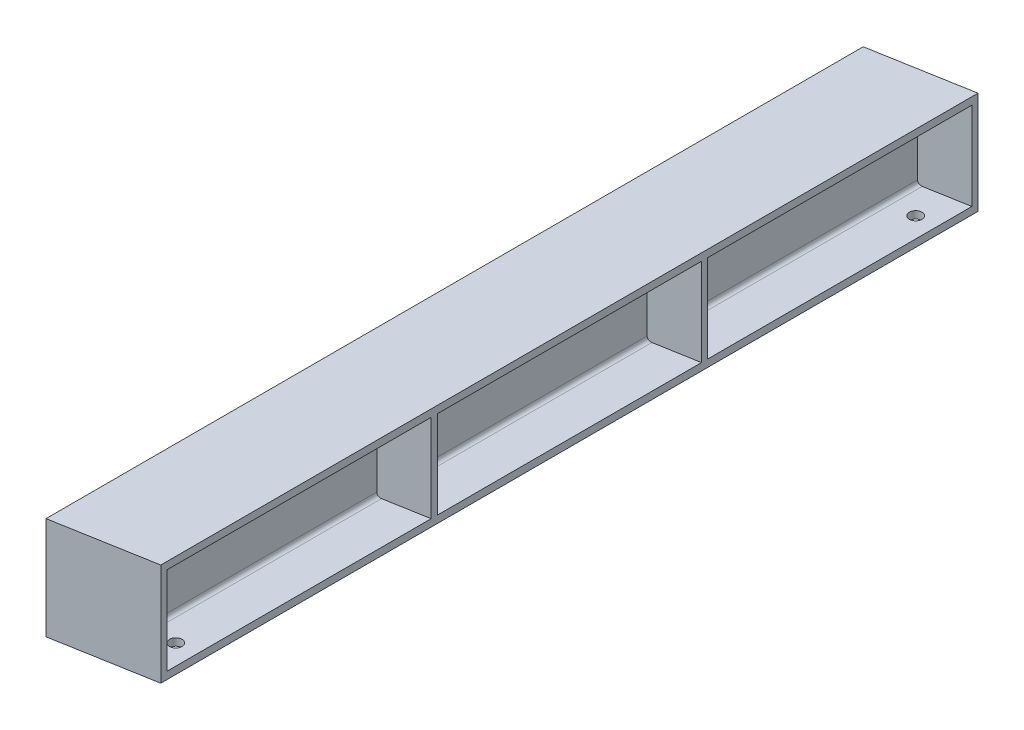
ISO-10303-21;
HEADER;
FILE_DESCRIPTION(('STEP AP214'),'2;1');
FILE_NAME('part.step','',(''),(''),'','','');
FILE_SCHEMA(('AUTOMOTIVE_DESIGN { 1 0 10303 214 1 1 1 1 }'));
ENDSEC;
DATA;
#1=APPLICATION_CONTEXT('core data for automotive mechanical design processes');
#2=APPLICATION_PROTOCOL_DEFINITION('international standard','automotive_design',2000,#1);
#3=PRODUCT_CONTEXT('',#1,'mechanical');
#4=PRODUCT('Part','Part','',(#3));
#5=PRODUCT_RELATED_PRODUCT_CATEGORY('part','',(#4));
#6=PRODUCT_DEFINITION_FORMATION('','',#4);
#7=PRODUCT_DEFINITION_CONTEXT('part definition',#1,'design');
#8=PRODUCT_DEFINITION('design','',#6,#7);
#9=PRODUCT_DEFINITION_SHAPE('','',#8);
#10=(LENGTH_UNIT() NAMED_UNIT(*) SI_UNIT(.MILLI.,.METRE.));
#11=(NAMED_UNIT(*) PLANE_ANGLE_UNIT() SI_UNIT($,.RADIAN.));
#12=(NAMED_UNIT(*) SI_UNIT($,.STERADIAN.) SOLID_ANGLE_UNIT());
#13=UNCERTAINTY_MEASURE_WITH_UNIT(LENGTH_MEASURE(1.E-05),#10,'distance_accuracy_value','');
#14=(GEOMETRIC_REPRESENTATION_CONTEXT(3) GLOBAL_UNCERTAINTY_ASSIGNED_CONTEXT((#13)) GLOBAL_UNIT_ASSIGNED_CONTEXT((#10,
#11,#12)) REPRESENTATION_CONTEXT('',''));
#15=CARTESIAN_POINT('',(0.,0.,0.));
#16=DIRECTION('',(0.,0.,1.));
#17=DIRECTION('',(1.,0.,0.));
#18=AXIS2_PLACEMENT_3D('',#15,#16,#17);
#19=CARTESIAN_POINT('',(0.,11.557,-660.4));
#20=DIRECTION('',(0.,1.,0.));
#21=DIRECTION('',(-1.,0.,0.));
#22=AXIS2_PLACEMENT_3D('',#19,#20,#21);
#23=PLANE('',#22);
#24=CARTESIAN_POINT('',(31.75,11.557,593.546540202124));
#25=DIRECTION('',(0.,1.,0.));
#26=DIRECTION('',(0.,0.,1.));
#27=AXIS2_PLACEMENT_3D('',#24,#25,#26);
#28=CIRCLE('',#27,9.92123999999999);
#29=CARTESIAN_POINT('',(31.75,11.557,603.467780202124));
#30=VERTEX_POINT('',#29);
#31=EDGE_CURVE('E652',#30,#30,#28,.T.);
#32=ORIENTED_EDGE('',*,*,#31,.F.);
#33=EDGE_LOOP('',(#32));
#34=FACE_BOUND('',#33,.T.);
#35=DIRECTION('',(-0.984809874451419,0.,0.173636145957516));
#36=VECTOR('',#35,1.);
#37=CARTESIAN_POINT('',(224.201054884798,11.557,611.198211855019));
#38=LINE('',#37,#36);
#39=CARTESIAN_POINT('',(66.802,11.557,638.949929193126));
#40=VERTEX_POINT('',#39);
#41=CARTESIAN_POINT('',(0.,11.557,650.728082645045));
#42=VERTEX_POINT('',#41);
#43=EDGE_CURVE('E347',#40,#42,#38,.T.);
#44=ORIENTED_EDGE('',*,*,#43,.F.);
#45=DIRECTION('',(0.,0.,1.));
#46=VECTOR('',#45,1.);
#47=CARTESIAN_POINT('',(66.802,11.557,-660.4));
#48=LINE('',#47,#46);
#49=CARTESIAN_POINT('',(66.802,11.557,220.655346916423));
#50=VERTEX_POINT('',#49);
#51=EDGE_CURVE('E383',#50,#40,#48,.T.);
#52=ORIENTED_EDGE('',*,*,#51,.F.);
#53=DIRECTION('',(0.984809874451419,0.,-0.173636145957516));
#54=VECTOR('',#53,1.);
#55=CARTESIAN_POINT('',(152.673270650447,11.557,205.515006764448));
#56=LINE('',#55,#54);
#57=CARTESIAN_POINT('',(0.,11.557,232.433500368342));
#58=VERTEX_POINT('',#57);
#59=EDGE_CURVE('E372',#58,#50,#56,.T.);
#60=ORIENTED_EDGE('',*,*,#59,.F.);
#61=DIRECTION('',(0.,0.,1.));
#62=VECTOR('',#61,1.);
#63=CARTESIAN_POINT('',(0.,11.557,-660.4));
#64=LINE('',#63,#62);
#65=EDGE_CURVE('E365',#58,#42,#64,.T.);
#66=ORIENTED_EDGE('',*,*,#65,.T.);
#67=EDGE_LOOP('',(#44,#52,#60,#66));
#68=FACE_BOUND('',#67,.T.);
#69=ADVANCED_FACE('F36',(#34,#68),#23,.T.);
#70=CARTESIAN_POINT('',(66.802,17.907,-660.4));
#71=DIRECTION('',(0.,0.,1.));
#72=DIRECTION('',(1.,0.,0.));
#73=AXIS2_PLACEMENT_3D('',#70,#71,#72);
#74=CYLINDRICAL_SURFACE('',#73,6.35);
#75=CARTESIAN_POINT('',(66.802,17.907,638.949929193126));
#76=DIRECTION('',(-0.173636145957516,0.,-0.984809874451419));
#77=DIRECTION('',(-0.984809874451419,0.,0.173636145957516));
#78=AXIS2_PLACEMENT_3D('',#75,#76,#77);
#79=ELLIPSE('',#78,6.44794509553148,6.35);
#80=CARTESIAN_POINT('',(73.152,17.907,637.830332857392));
#81=VERTEX_POINT('',#80);
#82=EDGE_CURVE('E353',#81,#40,#79,.T.);
#83=ORIENTED_EDGE('',*,*,#82,.F.);
#84=DIRECTION('',(0.,0.,1.));
#85=VECTOR('',#84,1.);
#86=CARTESIAN_POINT('',(73.152,17.907,-660.4));
#87=LINE('',#86,#85);
#88=CARTESIAN_POINT('',(73.152,17.907,219.535750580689));
#89=VERTEX_POINT('',#88);
#90=EDGE_CURVE('E693',#89,#81,#87,.T.);
#91=ORIENTED_EDGE('',*,*,#90,.F.);
#92=CARTESIAN_POINT('',(66.802,17.907,220.655346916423));
#93=DIRECTION('',(0.173636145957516,0.,0.984809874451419));
#94=DIRECTION('',(-0.984809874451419,0.,0.173636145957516));
#95=AXIS2_PLACEMENT_3D('',#92,#93,#94);
#96=ELLIPSE('',#95,6.44794509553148,6.35);
#97=EDGE_CURVE('E542',#50,#89,#96,.T.);
#98=ORIENTED_EDGE('',*,*,#97,.F.);
#99=ORIENTED_EDGE('',*,*,#51,.T.);
#100=EDGE_LOOP('',(#83,#91,#98,#99));
#101=FACE_BOUND('',#100,.T.);
#102=ADVANCED_FACE('F859',(#101),#74,.F.);
#103=CARTESIAN_POINT('',(73.152,17.907,-660.4));
#104=DIRECTION('',(-1.,0.,0.));
#105=DIRECTION('',(0.,-1.,0.));
#106=AXIS2_PLACEMENT_3D('',#103,#104,#105);
#107=PLANE('',#106);
#108=DIRECTION('',(0.,-1.,0.));
#109=VECTOR('',#108,1.);
#110=CARTESIAN_POINT('',(73.152,17.9069999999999,637.830332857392));
#111=LINE('',#110,#109);
#112=CARTESIAN_POINT('',(73.152,144.145,637.830332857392));
#113=VERTEX_POINT('',#112);
#114=EDGE_CURVE('E617',#113,#81,#111,.T.);
#115=ORIENTED_EDGE('',*,*,#114,.F.);
#116=DIRECTION('',(0.,0.,1.));
#117=VECTOR('',#116,1.);
#118=CARTESIAN_POINT('',(73.152,144.145,-660.4));
#119=LINE('',#118,#117);
#120=CARTESIAN_POINT('',(73.152,144.145,219.535750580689));
#121=VERTEX_POINT('',#120);
#122=EDGE_CURVE('E696',#121,#113,#119,.T.);
#123=ORIENTED_EDGE('',*,*,#122,.F.);
#124=DIRECTION('',(0.,1.,0.));
#125=VECTOR('',#124,1.);
#126=CARTESIAN_POINT('',(73.152,17.9069999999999,219.535750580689));
#127=LINE('',#126,#125);
#128=EDGE_CURVE('E544',#89,#121,#127,.T.);
#129=ORIENTED_EDGE('',*,*,#128,.F.);
#130=ORIENTED_EDGE('',*,*,#90,.T.);
#131=EDGE_LOOP('',(#115,#123,#129,#130));
#132=FACE_BOUND('',#131,.T.);
#133=ADVANCED_FACE('F864',(#132),#107,.T.);
#134=CARTESIAN_POINT('',(66.802,144.145,-660.4));
#135=DIRECTION('',(0.,0.,1.));
#136=DIRECTION('',(1.,0.,0.));
#137=AXIS2_PLACEMENT_3D('',#134,#135,#136);
#138=CYLINDRICAL_SURFACE('',#137,6.34999999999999);
#139=CARTESIAN_POINT('',(66.802,144.145,638.949929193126));
#140=DIRECTION('',(-0.173636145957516,0.,-0.984809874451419));
#141=DIRECTION('',(-0.984809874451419,0.,0.173636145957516));
#142=AXIS2_PLACEMENT_3D('',#139,#140,#141);
#143=ELLIPSE('',#142,6.44794509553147,6.34999999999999);
#144=CARTESIAN_POINT('',(66.8019999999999,150.495,638.949929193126));
#145=VERTEX_POINT('',#144);
#146=EDGE_CURVE('E619',#145,#113,#143,.T.);
#147=ORIENTED_EDGE('',*,*,#146,.F.);
#148=DIRECTION('',(0.,0.,1.));
#149=VECTOR('',#148,1.);
#150=CARTESIAN_POINT('',(66.802,150.495,-660.4));
#151=LINE('',#150,#149);
#152=CARTESIAN_POINT('',(66.8019999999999,150.495,220.655346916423));
#153=VERTEX_POINT('',#152);
#154=EDGE_CURVE('E715',#153,#145,#151,.T.);
#155=ORIENTED_EDGE('',*,*,#154,.F.);
#156=CARTESIAN_POINT('',(66.802,144.145,220.655346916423));
#157=DIRECTION('',(0.173636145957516,0.,0.984809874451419));
#158=DIRECTION('',(-0.984809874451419,0.,0.173636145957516));
#159=AXIS2_PLACEMENT_3D('',#156,#157,#158);
#160=ELLIPSE('',#159,6.44794509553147,6.34999999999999);
#161=EDGE_CURVE('E547',#121,#153,#160,.T.);
#162=ORIENTED_EDGE('',*,*,#161,.F.);
#163=ORIENTED_EDGE('',*,*,#122,.T.);
#164=EDGE_LOOP('',(#147,#155,#162,#163));
#165=FACE_BOUND('',#164,.T.);
#166=ADVANCED_FACE('F984',(#165),#138,.F.);
#167=CARTESIAN_POINT('',(66.802,150.495,-660.4));
#168=DIRECTION('',(0.,-1.,0.));
#169=DIRECTION('',(0.,0.,-1.));
#170=AXIS2_PLACEMENT_3D('',#167,#168,#169);
#171=PLANE('',#170);
#172=DIRECTION('',(0.984809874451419,0.,-0.173636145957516));
#173=VECTOR('',#172,1.);
#174=CARTESIAN_POINT('',(288.989007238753,150.495,599.775163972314));
#175=LINE('',#174,#173);
#176=CARTESIAN_POINT('',(0.,150.495,650.728082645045));
#177=VERTEX_POINT('',#176);
#178=EDGE_CURVE('E621',#177,#145,#175,.T.);
#179=ORIENTED_EDGE('',*,*,#178,.F.);
#180=DIRECTION('',(0.,0.,1.));
#181=VECTOR('',#180,1.);
#182=CARTESIAN_POINT('',(0.,150.495,-660.4));
#183=LINE('',#182,#181);
#184=CARTESIAN_POINT('',(0.,150.495,232.433500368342));
#185=VERTEX_POINT('',#184);
#186=EDGE_CURVE('E367',#185,#177,#183,.T.);
#187=ORIENTED_EDGE('',*,*,#186,.F.);
#188=DIRECTION('',(-0.984809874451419,0.,0.173636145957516));
#189=VECTOR('',#188,1.);
#190=CARTESIAN_POINT('',(217.461223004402,150.495,194.091958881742));
#191=LINE('',#190,#189);
#192=EDGE_CURVE('E550',#153,#185,#191,.T.);
#193=ORIENTED_EDGE('',*,*,#192,.F.);
#194=ORIENTED_EDGE('',*,*,#154,.T.);
#195=EDGE_LOOP('',(#179,#187,#193,#194));
#196=FACE_BOUND('',#195,.T.);
#197=ADVANCED_FACE('F971',(#196),#171,.T.);
#198=CARTESIAN_POINT('',(154.432,150.495,-660.4));
#199=DIRECTION('',(0.,-1.,0.));
#200=DIRECTION('',(0.,0.,-1.));
#201=AXIS2_PLACEMENT_3D('',#198,#199,#200);
#202=PLANE('',#201);
#203=DIRECTION('',(0.984809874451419,0.,-0.173636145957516));
#204=VECTOR('',#203,1.);
#205=CARTESIAN_POINT('',(373.977005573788,150.495,584.790557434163));
#206=LINE('',#205,#204);
#207=CARTESIAN_POINT('',(87.63,150.495,635.277653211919));
#208=VERTEX_POINT('',#207);
#209=CARTESIAN_POINT('',(154.432,150.495,623.49949976));
#210=VERTEX_POINT('',#209);
#211=EDGE_CURVE('E52',#208,#210,#206,.T.);
#212=ORIENTED_EDGE('',*,*,#211,.F.);
#213=DIRECTION('',(0.,0.,1.));
#214=VECTOR('',#213,1.);
#215=CARTESIAN_POINT('',(87.63,150.495,-660.4));
#216=LINE('',#215,#214);
#217=CARTESIAN_POINT('',(87.63,150.495,216.983070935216));
#218=VERTEX_POINT('',#217);
#219=EDGE_CURVE('E757',#218,#208,#216,.T.);
#220=ORIENTED_EDGE('',*,*,#219,.F.);
#221=DIRECTION('',(-0.984809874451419,0.,0.173636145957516));
#222=VECTOR('',#221,1.);
#223=CARTESIAN_POINT('',(302.449221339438,150.495,179.107352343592));
#224=LINE('',#223,#222);
#225=CARTESIAN_POINT('',(154.432,150.495,205.204917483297));
#226=VERTEX_POINT('',#225);
#227=EDGE_CURVE('E554',#226,#218,#224,.T.);
#228=ORIENTED_EDGE('',*,*,#227,.F.);
#229=DIRECTION('',(0.,0.,1.));
#230=VECTOR('',#229,1.);
#231=CARTESIAN_POINT('',(154.432,150.495,-660.4));
#232=LINE('',#231,#230);
#233=EDGE_CURVE('E752',#226,#210,#232,.T.);
#234=ORIENTED_EDGE('',*,*,#233,.T.);
#235=EDGE_LOOP('',(#212,#220,#228,#234));
#236=FACE_BOUND('',#235,.T.);
#237=ADVANCED_FACE('F838',(#236),#202,.T.);
#238=CARTESIAN_POINT('',(87.63,144.145,-660.4));
#239=DIRECTION('',(0.,0.,1.));
#240=DIRECTION('',(1.,0.,0.));
#241=AXIS2_PLACEMENT_3D('',#238,#239,#240);
#242=CYLINDRICAL_SURFACE('',#241,6.34999999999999);
#243=CARTESIAN_POINT('',(87.63,144.145,635.277653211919));
#244=DIRECTION('',(-0.173636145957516,0.,-0.984809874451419));
#245=DIRECTION('',(-0.984809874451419,0.,0.173636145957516));
#246=AXIS2_PLACEMENT_3D('',#243,#244,#245);
#247=ELLIPSE('',#246,6.44794509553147,6.34999999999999);
#248=CARTESIAN_POINT('',(81.28,144.145,636.397249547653));
#249=VERTEX_POINT('',#248);
#250=EDGE_CURVE('E59',#249,#208,#247,.T.);
#251=ORIENTED_EDGE('',*,*,#250,.F.);
#252=DIRECTION('',(0.,0.,1.));
#253=VECTOR('',#252,1.);
#254=CARTESIAN_POINT('',(81.28,144.145,-660.4));
#255=LINE('',#254,#253);
#256=CARTESIAN_POINT('',(81.28,144.145,218.10266727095));
#257=VERTEX_POINT('',#256);
#258=EDGE_CURVE('E762',#257,#249,#255,.T.);
#259=ORIENTED_EDGE('',*,*,#258,.F.);
#260=CARTESIAN_POINT('',(87.63,144.145,216.983070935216));
#261=DIRECTION('',(0.173636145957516,0.,0.984809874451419));
#262=DIRECTION('',(-0.984809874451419,0.,0.173636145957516));
#263=AXIS2_PLACEMENT_3D('',#260,#261,#262);
#264=ELLIPSE('',#263,6.44794509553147,6.34999999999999);
#265=EDGE_CURVE('E558',#218,#257,#264,.T.);
#266=ORIENTED_EDGE('',*,*,#265,.F.);
#267=ORIENTED_EDGE('',*,*,#219,.T.);
#268=EDGE_LOOP('',(#251,#259,#266,#267));
#269=FACE_BOUND('',#268,.T.);
#270=ADVANCED_FACE('F812',(#269),#242,.F.);
#271=CARTESIAN_POINT('',(81.28,144.145,-660.4));
#272=DIRECTION('',(1.,0.,0.));
#273=DIRECTION('',(0.,1.,0.));
#274=AXIS2_PLACEMENT_3D('',#271,#272,#273);
#275=PLANE('',#274);
#276=DIRECTION('',(0.,1.,0.));
#277=VECTOR('',#276,1.);
#278=CARTESIAN_POINT('',(81.28,144.145,636.397249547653));
#279=LINE('',#278,#277);
#280=CARTESIAN_POINT('',(81.28,17.907,636.397249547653));
#281=VERTEX_POINT('',#280);
#282=EDGE_CURVE('E625',#281,#249,#279,.T.);
#283=ORIENTED_EDGE('',*,*,#282,.F.);
#284=DIRECTION('',(0.,0.,1.));
#285=VECTOR('',#284,1.);
#286=CARTESIAN_POINT('',(81.28,17.907,-660.4));
#287=LINE('',#286,#285);
#288=CARTESIAN_POINT('',(81.28,17.907,218.10266727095));
#289=VERTEX_POINT('',#288);
#290=EDGE_CURVE('E768',#289,#281,#287,.T.);
#291=ORIENTED_EDGE('',*,*,#290,.F.);
#292=DIRECTION('',(0.,-1.,0.));
#293=VECTOR('',#292,1.);
#294=CARTESIAN_POINT('',(81.28,144.145,218.10266727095));
#295=LINE('',#294,#293);
#296=EDGE_CURVE('E562',#257,#289,#295,.T.);
#297=ORIENTED_EDGE('',*,*,#296,.F.);
#298=ORIENTED_EDGE('',*,*,#258,.T.);
#299=EDGE_LOOP('',(#283,#291,#297,#298));
#300=FACE_BOUND('',#299,.T.);
#301=ADVANCED_FACE('F819',(#300),#275,.T.);
#302=CARTESIAN_POINT('',(87.63,17.907,-660.4));
#303=DIRECTION('',(0.,0.,1.));
#304=DIRECTION('',(1.,0.,0.));
#305=AXIS2_PLACEMENT_3D('',#302,#303,#304);
#306=CYLINDRICAL_SURFACE('',#305,6.34999999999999);
#307=CARTESIAN_POINT('',(87.63,17.907,635.277653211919));
#308=DIRECTION('',(-0.173636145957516,0.,-0.984809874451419));
#309=DIRECTION('',(-0.984809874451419,0.,0.173636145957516));
#310=AXIS2_PLACEMENT_3D('',#307,#308,#309);
#311=ELLIPSE('',#310,6.44794509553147,6.34999999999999);
#312=CARTESIAN_POINT('',(87.63,11.557,635.277653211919));
#313=VERTEX_POINT('',#312);
#314=EDGE_CURVE('E628',#313,#281,#311,.T.);
#315=ORIENTED_EDGE('',*,*,#314,.F.);
#316=DIRECTION('',(0.,0.,1.));
#317=VECTOR('',#316,1.);
#318=CARTESIAN_POINT('',(87.63,11.557,-660.4));
#319=LINE('',#318,#317);
#320=CARTESIAN_POINT('',(87.63,11.557,216.983070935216));
#321=VERTEX_POINT('',#320);
#322=EDGE_CURVE('E773',#321,#313,#319,.T.);
#323=ORIENTED_EDGE('',*,*,#322,.F.);
#324=CARTESIAN_POINT('',(87.63,17.907,216.983070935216));
#325=DIRECTION('',(0.173636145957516,0.,0.984809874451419));
#326=DIRECTION('',(-0.984809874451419,0.,0.173636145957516));
#327=AXIS2_PLACEMENT_3D('',#324,#325,#326);
#328=ELLIPSE('',#327,6.44794509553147,6.34999999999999);
#329=EDGE_CURVE('E566',#289,#321,#328,.T.);
#330=ORIENTED_EDGE('',*,*,#329,.F.);
#331=ORIENTED_EDGE('',*,*,#290,.T.);
#332=EDGE_LOOP('',(#315,#323,#330,#331));
#333=FACE_BOUND('',#332,.T.);
#334=ADVANCED_FACE('F821',(#333),#306,.F.);
#335=CARTESIAN_POINT('',(87.63,11.557,-660.4));
#336=DIRECTION('',(0.,1.,0.));
#337=DIRECTION('',(-1.,0.,0.));
#338=AXIS2_PLACEMENT_3D('',#335,#336,#337);
#339=PLANE('',#338);
#340=CARTESIAN_POINT('',(122.682,11.557,577.513920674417));
#341=DIRECTION('',(0.,1.,0.));
#342=DIRECTION('',(0.,0.,1.));
#343=AXIS2_PLACEMENT_3D('',#340,#341,#342);
#344=CIRCLE('',#343,9.92124);
#345=CARTESIAN_POINT('',(122.682,11.557,587.435160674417));
#346=VERTEX_POINT('',#345);
#347=EDGE_CURVE('E646',#346,#346,#344,.T.);
#348=ORIENTED_EDGE('',*,*,#347,.F.);
#349=EDGE_LOOP('',(#348));
#350=FACE_BOUND('',#349,.T.);
#351=DIRECTION('',(-0.984809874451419,0.,0.173636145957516));
#352=VECTOR('',#351,1.);
#353=CARTESIAN_POINT('',(309.189053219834,11.5569999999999,596.213605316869));
#354=LINE('',#353,#352);
#355=CARTESIAN_POINT('',(154.432,11.557,623.49949976));
#356=VERTEX_POINT('',#355);
#357=EDGE_CURVE('E368',#356,#313,#354,.T.);
#358=ORIENTED_EDGE('',*,*,#357,.F.);
#359=DIRECTION('',(0.,0.,1.));
#360=VECTOR('',#359,1.);
#361=CARTESIAN_POINT('',(154.432,11.557,-660.4));
#362=LINE('',#361,#360);
#363=CARTESIAN_POINT('',(154.432,11.557,205.204917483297));
#364=VERTEX_POINT('',#363);
#365=EDGE_CURVE('E779',#364,#356,#362,.T.);
#366=ORIENTED_EDGE('',*,*,#365,.F.);
#367=DIRECTION('',(0.984809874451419,0.,-0.173636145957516));
#368=VECTOR('',#367,1.);
#369=CARTESIAN_POINT('',(237.661268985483,11.557,190.530400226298));
#370=LINE('',#369,#368);
#371=EDGE_CURVE('E569',#321,#364,#370,.T.);
#372=ORIENTED_EDGE('',*,*,#371,.F.);
#373=ORIENTED_EDGE('',*,*,#322,.T.);
#374=EDGE_LOOP('',(#358,#366,#372,#373));
#375=FACE_BOUND('',#374,.T.);
#376=ADVANCED_FACE('F842',(#350,#375),#339,.T.);
#377=DIRECTION('',(-0.984809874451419,0.,0.173636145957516));
#378=VECTOR('',#377,1.);
#379=CARTESIAN_POINT('',(151.019386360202,11.557,196.134692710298));
#380=LINE('',#379,#378);
#381=CARTESIAN_POINT('',(66.802,11.557,210.983429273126));
#382=VERTEX_POINT('',#381);
#383=CARTESIAN_POINT('',(0.,11.557,222.761582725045));
#384=VERTEX_POINT('',#383);
#385=EDGE_CURVE('E572',#382,#384,#380,.T.);
#386=ORIENTED_EDGE('',*,*,#385,.F.);
#387=CARTESIAN_POINT('',(66.802,11.557,-207.311153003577));
#388=VERTEX_POINT('',#387);
#389=EDGE_CURVE('E381',#388,#382,#48,.T.);
#390=ORIENTED_EDGE('',*,*,#389,.F.);
#391=DIRECTION('',(0.984809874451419,0.,-0.173636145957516));
#392=VECTOR('',#391,1.);
#393=CARTESIAN_POINT('',(79.4916021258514,11.557,-209.548512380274));
#394=LINE('',#393,#392);
#395=CARTESIAN_POINT('',(0.,11.557,-195.532999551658));
#396=VERTEX_POINT('',#395);
#397=EDGE_CURVE('E464',#396,#388,#394,.T.);
#398=ORIENTED_EDGE('',*,*,#397,.F.);
#399=EDGE_CURVE('E373',#396,#384,#64,.T.);
#400=ORIENTED_EDGE('',*,*,#399,.T.);
#401=EDGE_LOOP('',(#386,#390,#398,#400));
#402=FACE_BOUND('',#401,.T.);
#403=ADVANCED_FACE('F670',(#402),#23,.T.);
#404=CARTESIAN_POINT('',(66.802,17.907,210.983429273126));
#405=DIRECTION('',(-0.173636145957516,0.,-0.984809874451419));
#406=DIRECTION('',(-0.984809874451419,0.,0.173636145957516));
#407=AXIS2_PLACEMENT_3D('',#404,#405,#406);
#408=ELLIPSE('',#407,6.44794509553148,6.35);
#409=CARTESIAN_POINT('',(73.152,17.907,209.863832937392));
#410=VERTEX_POINT('',#409);
#411=EDGE_CURVE('E574',#410,#382,#408,.T.);
#412=ORIENTED_EDGE('',*,*,#411,.F.);
#413=CARTESIAN_POINT('',(73.152,17.907,-208.430749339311));
#414=VERTEX_POINT('',#413);
#415=EDGE_CURVE('E700',#414,#410,#87,.T.);
#416=ORIENTED_EDGE('',*,*,#415,.F.);
#417=CARTESIAN_POINT('',(66.802,17.907,-207.311153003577));
#418=DIRECTION('',(0.173636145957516,0.,0.984809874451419));
#419=DIRECTION('',(-0.984809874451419,0.,0.173636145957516));
#420=AXIS2_PLACEMENT_3D('',#417,#418,#419);
#421=ELLIPSE('',#420,6.44794509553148,6.35);
#422=EDGE_CURVE('E467',#388,#414,#421,.T.);
#423=ORIENTED_EDGE('',*,*,#422,.F.);
#424=ORIENTED_EDGE('',*,*,#389,.T.);
#425=EDGE_LOOP('',(#412,#416,#423,#424));
#426=FACE_BOUND('',#425,.T.);
#427=ADVANCED_FACE('F867',(#426),#74,.F.);
#428=DIRECTION('',(0.,-1.,0.));
#429=VECTOR('',#428,1.);
#430=CARTESIAN_POINT('',(73.152,17.9069999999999,209.863832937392));
#431=LINE('',#430,#429);
#432=CARTESIAN_POINT('',(73.152,144.145,209.863832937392));
#433=VERTEX_POINT('',#432);
#434=EDGE_CURVE('E576',#433,#410,#431,.T.);
#435=ORIENTED_EDGE('',*,*,#434,.F.);
#436=CARTESIAN_POINT('',(73.152,144.145,-208.430749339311));
#437=VERTEX_POINT('',#436);
#438=EDGE_CURVE('E694',#437,#433,#119,.T.);
#439=ORIENTED_EDGE('',*,*,#438,.F.);
#440=DIRECTION('',(0.,1.,0.));
#441=VECTOR('',#440,1.);
#442=CARTESIAN_POINT('',(73.152,17.907,-208.430749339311));
#443=LINE('',#442,#441);
#444=EDGE_CURVE('E470',#414,#437,#443,.T.);
#445=ORIENTED_EDGE('',*,*,#444,.F.);
#446=ORIENTED_EDGE('',*,*,#415,.T.);
#447=EDGE_LOOP('',(#435,#439,#445,#446));
#448=FACE_BOUND('',#447,.T.);
#449=ADVANCED_FACE('F875',(#448),#107,.T.);
#450=CARTESIAN_POINT('',(66.802,144.145,210.983429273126));
#451=DIRECTION('',(-0.173636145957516,0.,-0.984809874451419));
#452=DIRECTION('',(-0.984809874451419,0.,0.173636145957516));
#453=AXIS2_PLACEMENT_3D('',#450,#451,#452);
#454=ELLIPSE('',#453,6.44794509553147,6.34999999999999);
#455=CARTESIAN_POINT('',(66.8019999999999,150.495,210.983429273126));
#456=VERTEX_POINT('',#455);
#457=EDGE_CURVE('E579',#456,#433,#454,.T.);
#458=ORIENTED_EDGE('',*,*,#457,.F.);
#459=CARTESIAN_POINT('',(66.8019999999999,150.495,-207.311153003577));
#460=VERTEX_POINT('',#459);
#461=EDGE_CURVE('E714',#460,#456,#151,.T.);
#462=ORIENTED_EDGE('',*,*,#461,.F.);
#463=CARTESIAN_POINT('',(66.802,144.145,-207.311153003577));
#464=DIRECTION('',(0.173636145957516,0.,0.984809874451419));
#465=DIRECTION('',(-0.984809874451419,0.,0.173636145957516));
#466=AXIS2_PLACEMENT_3D('',#463,#464,#465);
#467=ELLIPSE('',#466,6.44794509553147,6.34999999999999);
#468=EDGE_CURVE('E473',#437,#460,#467,.T.);
#469=ORIENTED_EDGE('',*,*,#468,.F.);
#470=ORIENTED_EDGE('',*,*,#438,.T.);
#471=EDGE_LOOP('',(#458,#462,#469,#470));
#472=FACE_BOUND('',#471,.T.);
#473=ADVANCED_FACE('F901',(#472),#138,.F.);
#474=DIRECTION('',(0.984809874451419,0.,-0.173636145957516));
#475=VECTOR('',#474,1.);
#476=CARTESIAN_POINT('',(215.807338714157,150.495,184.711644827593));
#477=LINE('',#476,#475);
#478=CARTESIAN_POINT('',(0.,150.495,222.761582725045));
#479=VERTEX_POINT('',#478);
#480=EDGE_CURVE('E582',#479,#456,#477,.T.);
#481=ORIENTED_EDGE('',*,*,#480,.F.);
#482=CARTESIAN_POINT('',(0.,150.495,-195.532999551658));
#483=VERTEX_POINT('',#482);
#484=EDGE_CURVE('E732',#483,#479,#183,.T.);
#485=ORIENTED_EDGE('',*,*,#484,.F.);
#486=DIRECTION('',(-0.984809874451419,0.,0.173636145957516));
#487=VECTOR('',#486,1.);
#488=CARTESIAN_POINT('',(144.279554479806,150.495,-220.971560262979));
#489=LINE('',#488,#487);
#490=EDGE_CURVE('E476',#460,#483,#489,.T.);
#491=ORIENTED_EDGE('',*,*,#490,.F.);
#492=ORIENTED_EDGE('',*,*,#461,.T.);
#493=EDGE_LOOP('',(#481,#485,#491,#492));
#494=FACE_BOUND('',#493,.T.);
#495=ADVANCED_FACE('F904',(#494),#171,.T.);
#496=DIRECTION('',(0.984809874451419,0.,-0.173636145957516));
#497=VECTOR('',#496,1.);
#498=CARTESIAN_POINT('',(300.795337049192,150.495,169.727038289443));
#499=LINE('',#498,#497);
#500=CARTESIAN_POINT('',(87.63,150.495,207.311153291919));
#501=VERTEX_POINT('',#500);
#502=CARTESIAN_POINT('',(154.432,150.495,195.53299984));
#503=VERTEX_POINT('',#502);
#504=EDGE_CURVE('E585',#501,#503,#499,.T.);
#505=ORIENTED_EDGE('',*,*,#504,.F.);
#506=CARTESIAN_POINT('',(87.63,150.495,-210.983428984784));
#507=VERTEX_POINT('',#506);
#508=EDGE_CURVE('E756',#507,#501,#216,.T.);
#509=ORIENTED_EDGE('',*,*,#508,.F.);
#510=DIRECTION('',(-0.984809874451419,0.,0.173636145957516));
#511=VECTOR('',#510,1.);
#512=CARTESIAN_POINT('',(229.267552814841,150.495,-235.956166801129));
#513=LINE('',#512,#511);
#514=CARTESIAN_POINT('',(154.432,150.495,-222.761582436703));
#515=VERTEX_POINT('',#514);
#516=EDGE_CURVE('E480',#515,#507,#513,.T.);
#517=ORIENTED_EDGE('',*,*,#516,.F.);
#518=EDGE_CURVE('E751',#515,#503,#232,.T.);
#519=ORIENTED_EDGE('',*,*,#518,.T.);
#520=EDGE_LOOP('',(#505,#509,#517,#519));
#521=FACE_BOUND('',#520,.T.);
#522=ADVANCED_FACE('F804',(#521),#202,.T.);
#523=CARTESIAN_POINT('',(87.63,144.145,207.311153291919));
#524=DIRECTION('',(-0.173636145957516,0.,-0.984809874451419));
#525=DIRECTION('',(-0.984809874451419,0.,0.173636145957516));
#526=AXIS2_PLACEMENT_3D('',#523,#524,#525);
#527=ELLIPSE('',#526,6.44794509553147,6.34999999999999);
#528=CARTESIAN_POINT('',(81.28,144.145,208.430749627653));
#529=VERTEX_POINT('',#528);
#530=EDGE_CURVE('E589',#529,#501,#527,.T.);
#531=ORIENTED_EDGE('',*,*,#530,.F.);
#532=CARTESIAN_POINT('',(81.28,144.145,-209.86383264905));
#533=VERTEX_POINT('',#532);
#534=EDGE_CURVE('E761',#533,#529,#255,.T.);
#535=ORIENTED_EDGE('',*,*,#534,.F.);
#536=CARTESIAN_POINT('',(87.63,144.145,-210.983428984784));
#537=DIRECTION('',(0.173636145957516,0.,0.984809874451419));
#538=DIRECTION('',(-0.984809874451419,0.,0.173636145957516));
#539=AXIS2_PLACEMENT_3D('',#536,#537,#538);
#540=ELLIPSE('',#539,6.44794509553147,6.34999999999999);
#541=EDGE_CURVE('E484',#507,#533,#540,.T.);
#542=ORIENTED_EDGE('',*,*,#541,.F.);
#543=ORIENTED_EDGE('',*,*,#508,.T.);
#544=EDGE_LOOP('',(#531,#535,#542,#543));
#545=FACE_BOUND('',#544,.T.);
#546=ADVANCED_FACE('F806',(#545),#242,.F.);
#547=DIRECTION('',(0.,1.,0.));
#548=VECTOR('',#547,1.);
#549=CARTESIAN_POINT('',(81.28,144.145,208.430749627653));
#550=LINE('',#549,#548);
#551=CARTESIAN_POINT('',(81.28,17.907,208.430749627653));
#552=VERTEX_POINT('',#551);
#553=EDGE_CURVE('E593',#552,#529,#550,.T.);
#554=ORIENTED_EDGE('',*,*,#553,.F.);
#555=CARTESIAN_POINT('',(81.28,17.907,-209.86383264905));
#556=VERTEX_POINT('',#555);
#557=EDGE_CURVE('E767',#556,#552,#287,.T.);
#558=ORIENTED_EDGE('',*,*,#557,.F.);
#559=DIRECTION('',(0.,-1.,0.));
#560=VECTOR('',#559,1.);
#561=CARTESIAN_POINT('',(81.28,144.145,-209.86383264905));
#562=LINE('',#561,#560);
#563=EDGE_CURVE('E488',#533,#556,#562,.T.);
#564=ORIENTED_EDGE('',*,*,#563,.F.);
#565=ORIENTED_EDGE('',*,*,#534,.T.);
#566=EDGE_LOOP('',(#554,#558,#564,#565));
#567=FACE_BOUND('',#566,.T.);
#568=ADVANCED_FACE('F831',(#567),#275,.T.);
#569=CARTESIAN_POINT('',(87.63,17.907,207.311153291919));
#570=DIRECTION('',(-0.173636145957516,0.,-0.984809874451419));
#571=DIRECTION('',(-0.984809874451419,0.,0.173636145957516));
#572=AXIS2_PLACEMENT_3D('',#569,#570,#571);
#573=ELLIPSE('',#572,6.44794509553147,6.34999999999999);
#574=CARTESIAN_POINT('',(87.63,11.557,207.311153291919));
#575=VERTEX_POINT('',#574);
#576=EDGE_CURVE('E597',#575,#552,#573,.T.);
#577=ORIENTED_EDGE('',*,*,#576,.F.);
#578=CARTESIAN_POINT('',(87.63,11.557,-210.983428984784));
#579=VERTEX_POINT('',#578);
#580=EDGE_CURVE('E772',#579,#575,#319,.T.);
#581=ORIENTED_EDGE('',*,*,#580,.F.);
#582=CARTESIAN_POINT('',(87.63,17.907,-210.983428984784));
#583=DIRECTION('',(0.173636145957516,0.,0.984809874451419));
#584=DIRECTION('',(-0.984809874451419,0.,0.173636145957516));
#585=AXIS2_PLACEMENT_3D('',#582,#583,#584);
#586=ELLIPSE('',#585,6.44794509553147,6.34999999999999);
#587=EDGE_CURVE('E492',#556,#579,#586,.T.);
#588=ORIENTED_EDGE('',*,*,#587,.F.);
#589=ORIENTED_EDGE('',*,*,#557,.T.);
#590=EDGE_LOOP('',(#577,#581,#588,#589));
#591=FACE_BOUND('',#590,.T.);
#592=ADVANCED_FACE('F828',(#591),#306,.F.);
#593=DIRECTION('',(-0.984809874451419,0.,0.173636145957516));
#594=VECTOR('',#593,1.);
#595=CARTESIAN_POINT('',(236.007384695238,11.557,181.150086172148));
#596=LINE('',#595,#594);
#597=CARTESIAN_POINT('',(154.432,11.557,195.53299984));
#598=VERTEX_POINT('',#597);
#599=EDGE_CURVE('E600',#598,#575,#596,.T.);
#600=ORIENTED_EDGE('',*,*,#599,.F.);
#601=CARTESIAN_POINT('',(154.432,11.557,-222.761582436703));
#602=VERTEX_POINT('',#601);
#603=EDGE_CURVE('E778',#602,#598,#362,.T.);
#604=ORIENTED_EDGE('',*,*,#603,.F.);
#605=DIRECTION('',(0.984809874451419,0.,-0.173636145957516));
#606=VECTOR('',#605,1.);
#607=CARTESIAN_POINT('',(164.479600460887,11.557,-224.533118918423));
#608=LINE('',#607,#606);
#609=EDGE_CURVE('E11',#579,#602,#608,.T.);
#610=ORIENTED_EDGE('',*,*,#609,.F.);
#611=ORIENTED_EDGE('',*,*,#580,.T.);
#612=EDGE_LOOP('',(#600,#604,#610,#611));
#613=FACE_BOUND('',#612,.T.);
#614=ADVANCED_FACE('F843',(#613),#339,.T.);
#615=CARTESIAN_POINT('',(154.432,0.,-660.4));
#616=DIRECTION('',(0.,-1.,0.));
#617=DIRECTION('',(0.,0.,-1.));
#618=AXIS2_PLACEMENT_3D('',#615,#616,#617);
#619=PLANE('',#618);
#620=CARTESIAN_POINT('',(31.75,0.,-577.513920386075));
#621=DIRECTION('',(0.,1.,0.));
#622=DIRECTION('',(0.,0.,1.));
#623=AXIS2_PLACEMENT_3D('',#620,#621,#622);
#624=CIRCLE('',#623,9.92124);
#625=CARTESIAN_POINT('',(31.75,0.,-567.592680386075));
#626=VERTEX_POINT('',#625);
#627=EDGE_CURVE('E655',#626,#626,#624,.T.);
#628=ORIENTED_EDGE('',*,*,#627,.T.);
#629=EDGE_LOOP('',(#628));
#630=FACE_BOUND('',#629,.T.);
#631=CARTESIAN_POINT('',(31.75,0.,593.546540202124));
#632=DIRECTION('',(0.,1.,0.));
#633=DIRECTION('',(0.,0.,1.));
#634=AXIS2_PLACEMENT_3D('',#631,#632,#633);
#635=CIRCLE('',#634,9.92124);
#636=CARTESIAN_POINT('',(31.75,0.,603.467780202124));
#637=VERTEX_POINT('',#636);
#638=EDGE_CURVE('E649',#637,#637,#635,.T.);
#639=ORIENTED_EDGE('',*,*,#638,.T.);
#640=EDGE_LOOP('',(#639));
#641=FACE_BOUND('',#640,.T.);
#642=CARTESIAN_POINT('',(122.682,0.,577.513920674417));
#643=DIRECTION('',(0.,1.,0.));
#644=DIRECTION('',(0.,0.,1.));
#645=AXIS2_PLACEMENT_3D('',#642,#643,#644);
#646=CIRCLE('',#645,9.92124);
#647=CARTESIAN_POINT('',(122.682,0.,587.435160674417));
#648=VERTEX_POINT('',#647);
#649=EDGE_CURVE('E643',#648,#648,#646,.T.);
#650=ORIENTED_EDGE('',*,*,#649,.T.);
#651=EDGE_LOOP('',(#650));
#652=FACE_BOUND('',#651,.T.);
#653=CARTESIAN_POINT('',(122.682,0.,-593.546539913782));
#654=DIRECTION('',(0.,1.,0.));
#655=DIRECTION('',(0.,0.,1.));
#656=AXIS2_PLACEMENT_3D('',#653,#654,#655);
#657=CIRCLE('',#656,9.92124);
#658=CARTESIAN_POINT('',(122.682,0.,-583.625299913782));
#659=VERTEX_POINT('',#658);
#660=EDGE_CURVE('E634',#659,#659,#657,.T.);
#661=ORIENTED_EDGE('',*,*,#660,.T.);
#662=EDGE_LOOP('',(#661));
#663=FACE_BOUND('',#662,.T.);
#664=DIRECTION('',(0.,0.,1.));
#665=VECTOR('',#664,1.);
#666=CARTESIAN_POINT('',(154.432,0.,-660.4));
#667=LINE('',#666,#665);
#668=CARTESIAN_POINT('',(154.432,0.,-660.4));
#669=VERTEX_POINT('',#668);
#670=CARTESIAN_POINT('',(154.432,0.,633.171417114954));
#671=VERTEX_POINT('',#670);
#672=EDGE_CURVE('E410',#669,#671,#667,.T.);
#673=ORIENTED_EDGE('',*,*,#672,.T.);
#674=DIRECTION('',(-0.984809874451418,0.,0.173636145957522));
#675=VECTOR('',#674,1.);
#676=CARTESIAN_POINT('',(154.432,0.,633.171417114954));
#677=LINE('',#676,#675);
#678=CARTESIAN_POINT('',(0.,0.,660.4));
#679=VERTEX_POINT('',#678);
#680=EDGE_CURVE('E423',#671,#679,#677,.T.);
#681=ORIENTED_EDGE('',*,*,#680,.T.);
#682=DIRECTION('',(0.,0.,1.));
#683=VECTOR('',#682,1.);
#684=CARTESIAN_POINT('',(0.,0.,-660.4));
#685=LINE('',#684,#683);
#686=CARTESIAN_POINT('',(0.,0.,-633.171417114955));
#687=VERTEX_POINT('',#686);
#688=EDGE_CURVE('E387',#687,#679,#685,.T.);
#689=ORIENTED_EDGE('',*,*,#688,.F.);
#690=DIRECTION('',(0.984809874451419,0.,-0.173636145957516));
#691=VECTOR('',#690,1.);
#692=CARTESIAN_POINT('',(154.432,0.,-660.4));
#693=LINE('',#692,#691);
#694=EDGE_CURVE('E413',#687,#669,#693,.T.);
#695=ORIENTED_EDGE('',*,*,#694,.T.);
#696=EDGE_LOOP('',(#673,#681,#689,#695));
#697=FACE_BOUND('',#696,.T.);
#698=ADVANCED_FACE('F38',(#630,#641,#652,#663,#697),#619,.T.);
#699=CARTESIAN_POINT('',(0.,0.,-660.4));
#700=DIRECTION('',(-1.,0.,0.));
#701=DIRECTION('',(0.,-1.,0.));
#702=AXIS2_PLACEMENT_3D('',#699,#700,#701);
#703=PLANE('',#702);
#704=DIRECTION('',(0.,-1.,0.));
#705=VECTOR('',#704,1.);
#706=CARTESIAN_POINT('',(0.,0.,660.4));
#707=LINE('',#706,#705);
#708=CARTESIAN_POINT('',(0.,162.052,660.4));
#709=VERTEX_POINT('',#708);
#710=EDGE_CURVE('E404',#709,#679,#707,.T.);
#711=ORIENTED_EDGE('',*,*,#710,.F.);
#712=DIRECTION('',(0.,0.,1.));
#713=VECTOR('',#712,1.);
#714=CARTESIAN_POINT('',(0.,162.052,-660.4));
#715=LINE('',#714,#713);
#716=CARTESIAN_POINT('',(0.,162.052,-633.171417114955));
#717=VERTEX_POINT('',#716);
#718=EDGE_CURVE('E739',#717,#709,#715,.T.);
#719=ORIENTED_EDGE('',*,*,#718,.F.);
#720=DIRECTION('',(0.,1.,0.));
#721=VECTOR('',#720,1.);
#722=CARTESIAN_POINT('',(0.,0.,-633.171417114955));
#723=LINE('',#722,#721);
#724=EDGE_CURVE('E407',#687,#717,#723,.T.);
#725=ORIENTED_EDGE('',*,*,#724,.F.);
#726=ORIENTED_EDGE('',*,*,#688,.T.);
#727=EDGE_LOOP('',(#711,#719,#725,#726));
#728=FACE_BOUND('',#727,.T.);
#729=ORIENTED_EDGE('',*,*,#186,.T.);
#730=DIRECTION('',(0.,1.,0.));
#731=VECTOR('',#730,1.);
#732=CARTESIAN_POINT('',(0.,-158.779373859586,650.728082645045));
#733=LINE('',#732,#731);
#734=EDGE_CURVE('E350',#42,#177,#733,.T.);
#735=ORIENTED_EDGE('',*,*,#734,.F.);
#736=ORIENTED_EDGE('',*,*,#65,.F.);
#737=DIRECTION('',(0.,1.,0.));
#738=VECTOR('',#737,1.);
#739=CARTESIAN_POINT('',(0.,-158.779373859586,232.433500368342));
#740=LINE('',#739,#738);
#741=EDGE_CURVE('E603',#58,#185,#740,.T.);
#742=ORIENTED_EDGE('',*,*,#741,.T.);
#743=EDGE_LOOP('',(#729,#735,#736,#742));
#744=FACE_BOUND('',#743,.T.);
#745=ORIENTED_EDGE('',*,*,#484,.T.);
#746=DIRECTION('',(0.,1.,0.));
#747=VECTOR('',#746,1.);
#748=CARTESIAN_POINT('',(0.,-158.779373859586,222.761582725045));
#749=LINE('',#748,#747);
#750=EDGE_CURVE('E606',#384,#479,#749,.T.);
#751=ORIENTED_EDGE('',*,*,#750,.F.);
#752=ORIENTED_EDGE('',*,*,#399,.F.);
#753=DIRECTION('',(0.,1.,0.));
#754=VECTOR('',#753,1.);
#755=CARTESIAN_POINT('',(0.,-158.779373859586,-195.532999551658));
#756=LINE('',#755,#754);
#757=EDGE_CURVE('E527',#396,#483,#756,.T.);
#758=ORIENTED_EDGE('',*,*,#757,.T.);
#759=EDGE_LOOP('',(#745,#751,#752,#758));
#760=FACE_BOUND('',#759,.T.);
#761=CARTESIAN_POINT('',(0.,150.495,-623.499499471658));
#762=VERTEX_POINT('',#761);
#763=CARTESIAN_POINT('',(0.,150.495,-205.204917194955));
#764=VERTEX_POINT('',#763);
#765=EDGE_CURVE('E726',#762,#764,#183,.T.);
#766=ORIENTED_EDGE('',*,*,#765,.T.);
#767=DIRECTION('',(0.,1.,0.));
#768=VECTOR('',#767,1.);
#769=CARTESIAN_POINT('',(0.,-158.779373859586,-205.204917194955));
#770=LINE('',#769,#768);
#771=CARTESIAN_POINT('',(0.,11.557,-205.204917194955));
#772=VERTEX_POINT('',#771);
#773=EDGE_CURVE('E530',#772,#764,#770,.T.);
#774=ORIENTED_EDGE('',*,*,#773,.F.);
#775=CARTESIAN_POINT('',(0.,11.557,-623.499499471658));
#776=VERTEX_POINT('',#775);
#777=EDGE_CURVE('E376',#776,#772,#64,.T.);
#778=ORIENTED_EDGE('',*,*,#777,.F.);
#779=DIRECTION('',(0.,1.,0.));
#780=VECTOR('',#779,1.);
#781=CARTESIAN_POINT('',(0.,-158.779373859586,-623.499499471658));
#782=LINE('',#781,#780);
#783=EDGE_CURVE('E458',#776,#762,#782,.T.);
#784=ORIENTED_EDGE('',*,*,#783,.T.);
#785=EDGE_LOOP('',(#766,#774,#778,#784));
#786=FACE_BOUND('',#785,.T.);
#787=ADVANCED_FACE('F363',(#728,#744,#760,#786),#703,.T.);
#788=CARTESIAN_POINT('',(31.75,11.557,-577.513920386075));
#789=DIRECTION('',(0.,1.,0.));
#790=DIRECTION('',(0.,0.,1.));
#791=AXIS2_PLACEMENT_3D('',#788,#789,#790);
#792=CIRCLE('',#791,9.92123999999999);
#793=CARTESIAN_POINT('',(31.75,11.557,-567.592680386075));
#794=VERTEX_POINT('',#793);
#795=EDGE_CURVE('E659',#794,#794,#792,.T.);
#796=ORIENTED_EDGE('',*,*,#795,.F.);
#797=EDGE_LOOP('',(#796));
#798=FACE_BOUND('',#797,.T.);
#799=DIRECTION('',(-0.984809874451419,0.,0.173636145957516));
#800=VECTOR('',#799,1.);
#801=CARTESIAN_POINT('',(77.837717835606,11.557,-218.928826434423));
#802=LINE('',#801,#800);
#803=CARTESIAN_POINT('',(66.802,11.557,-216.983070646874));
#804=VERTEX_POINT('',#803);
#805=EDGE_CURVE('E496',#804,#772,#802,.T.);
#806=ORIENTED_EDGE('',*,*,#805,.F.);
#807=CARTESIAN_POINT('',(66.802,11.557,-635.277652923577));
#808=VERTEX_POINT('',#807);
#809=EDGE_CURVE('E374',#808,#804,#48,.T.);
#810=ORIENTED_EDGE('',*,*,#809,.F.);
#811=DIRECTION('',(0.984809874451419,0.,-0.173636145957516));
#812=VECTOR('',#811,1.);
#813=CARTESIAN_POINT('',(6.30993360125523,11.557,-624.612031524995));
#814=LINE('',#813,#812);
#815=EDGE_CURVE('E427',#776,#808,#814,.T.);
#816=ORIENTED_EDGE('',*,*,#815,.F.);
#817=ORIENTED_EDGE('',*,*,#777,.T.);
#818=EDGE_LOOP('',(#806,#810,#816,#817));
#819=FACE_BOUND('',#818,.T.);
#820=ADVANCED_FACE('F666',(#798,#819),#23,.T.);
#821=CARTESIAN_POINT('',(66.802,17.907,-216.983070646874));
#822=DIRECTION('',(-0.173636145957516,0.,-0.984809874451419));
#823=DIRECTION('',(-0.984809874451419,0.,0.173636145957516));
#824=AXIS2_PLACEMENT_3D('',#821,#822,#823);
#825=ELLIPSE('',#824,6.44794509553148,6.35);
#826=CARTESIAN_POINT('',(73.152,17.907,-218.102666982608));
#827=VERTEX_POINT('',#826);
#828=EDGE_CURVE('E499',#827,#804,#825,.T.);
#829=ORIENTED_EDGE('',*,*,#828,.F.);
#830=CARTESIAN_POINT('',(73.152,17.907,-636.397249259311));
#831=VERTEX_POINT('',#830);
#832=EDGE_CURVE('E679',#831,#827,#87,.T.);
#833=ORIENTED_EDGE('',*,*,#832,.F.);
#834=CARTESIAN_POINT('',(66.802,17.907,-635.277652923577));
#835=DIRECTION('',(0.173636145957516,0.,0.984809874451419));
#836=DIRECTION('',(-0.984809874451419,0.,0.173636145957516));
#837=AXIS2_PLACEMENT_3D('',#834,#835,#836);
#838=ELLIPSE('',#837,6.44794509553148,6.35);
#839=EDGE_CURVE('E431',#808,#831,#838,.T.);
#840=ORIENTED_EDGE('',*,*,#839,.F.);
#841=ORIENTED_EDGE('',*,*,#809,.T.);
#842=EDGE_LOOP('',(#829,#833,#840,#841));
#843=FACE_BOUND('',#842,.T.);
#844=ADVANCED_FACE('F668',(#843),#74,.F.);
#845=DIRECTION('',(0.,-1.,0.));
#846=VECTOR('',#845,1.);
#847=CARTESIAN_POINT('',(73.152,17.907,-218.102666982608));
#848=LINE('',#847,#846);
#849=CARTESIAN_POINT('',(73.152,144.145,-218.102666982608));
#850=VERTEX_POINT('',#849);
#851=EDGE_CURVE('E502',#850,#827,#848,.T.);
#852=ORIENTED_EDGE('',*,*,#851,.F.);
#853=CARTESIAN_POINT('',(73.152,144.145,-636.397249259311));
#854=VERTEX_POINT('',#853);
#855=EDGE_CURVE('E689',#854,#850,#119,.T.);
#856=ORIENTED_EDGE('',*,*,#855,.F.);
#857=DIRECTION('',(0.,1.,0.));
#858=VECTOR('',#857,1.);
#859=CARTESIAN_POINT('',(73.152,17.907,-636.397249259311));
#860=LINE('',#859,#858);
#861=EDGE_CURVE('E433',#831,#854,#860,.T.);
#862=ORIENTED_EDGE('',*,*,#861,.F.);
#863=ORIENTED_EDGE('',*,*,#832,.T.);
#864=EDGE_LOOP('',(#852,#856,#862,#863));
#865=FACE_BOUND('',#864,.T.);
#866=ADVANCED_FACE('F687',(#865),#107,.T.);
#867=CARTESIAN_POINT('',(66.802,144.145,-216.983070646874));
#868=DIRECTION('',(-0.173636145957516,0.,-0.984809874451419));
#869=DIRECTION('',(-0.984809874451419,0.,0.173636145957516));
#870=AXIS2_PLACEMENT_3D('',#867,#868,#869);
#871=ELLIPSE('',#870,6.44794509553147,6.34999999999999);
#872=CARTESIAN_POINT('',(66.8019999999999,150.495,-216.983070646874));
#873=VERTEX_POINT('',#872);
#874=EDGE_CURVE('E505',#873,#850,#871,.T.);
#875=ORIENTED_EDGE('',*,*,#874,.F.);
#876=CARTESIAN_POINT('',(66.802,150.495,-635.277652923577));
#877=VERTEX_POINT('',#876);
#878=EDGE_CURVE('E707',#877,#873,#151,.T.);
#879=ORIENTED_EDGE('',*,*,#878,.F.);
#880=CARTESIAN_POINT('',(66.802,144.145,-635.277652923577));
#881=DIRECTION('',(0.173636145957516,0.,0.984809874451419));
#882=DIRECTION('',(-0.984809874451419,0.,0.173636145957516));
#883=AXIS2_PLACEMENT_3D('',#880,#881,#882);
#884=ELLIPSE('',#883,6.44794509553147,6.34999999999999);
#885=EDGE_CURVE('E436',#854,#877,#884,.T.);
#886=ORIENTED_EDGE('',*,*,#885,.F.);
#887=ORIENTED_EDGE('',*,*,#855,.T.);
#888=EDGE_LOOP('',(#875,#879,#886,#887));
#889=FACE_BOUND('',#888,.T.);
#890=ADVANCED_FACE('F983',(#889),#138,.F.);
#891=DIRECTION('',(0.984809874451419,0.,-0.173636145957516));
#892=VECTOR('',#891,1.);
#893=CARTESIAN_POINT('',(142.625670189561,150.495,-230.351874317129));
#894=LINE('',#893,#892);
#895=EDGE_CURVE('E508',#764,#873,#894,.T.);
#896=ORIENTED_EDGE('',*,*,#895,.F.);
#897=ORIENTED_EDGE('',*,*,#765,.F.);
#898=DIRECTION('',(-0.984809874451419,0.,0.173636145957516));
#899=VECTOR('',#898,1.);
#900=CARTESIAN_POINT('',(71.0978859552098,150.495,-636.0350794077));
#901=LINE('',#900,#899);
#902=EDGE_CURVE('E439',#877,#762,#901,.T.);
#903=ORIENTED_EDGE('',*,*,#902,.F.);
#904=ORIENTED_EDGE('',*,*,#878,.T.);
#905=EDGE_LOOP('',(#896,#897,#903,#904));
#906=FACE_BOUND('',#905,.T.);
#907=ADVANCED_FACE('F978',(#906),#171,.T.);
#908=CARTESIAN_POINT('',(0.,162.052,-660.4));
#909=DIRECTION('',(0.,1.,0.));
#910=DIRECTION('',(0.,0.,1.));
#911=AXIS2_PLACEMENT_3D('',#908,#909,#910);
#912=PLANE('',#911);
#913=ORIENTED_EDGE('',*,*,#718,.T.);
#914=DIRECTION('',(-0.984809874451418,0.,0.173636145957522));
#915=VECTOR('',#914,1.);
#916=CARTESIAN_POINT('',(154.432,162.052,633.171417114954));
#917=LINE('',#916,#915);
#918=CARTESIAN_POINT('',(154.432,162.052,633.171417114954));
#919=VERTEX_POINT('',#918);
#920=EDGE_CURVE('E424',#919,#709,#917,.T.);
#921=ORIENTED_EDGE('',*,*,#920,.F.);
#922=DIRECTION('',(0.,0.,1.));
#923=VECTOR('',#922,1.);
#924=CARTESIAN_POINT('',(154.432,162.052,-660.4));
#925=LINE('',#924,#923);
#926=CARTESIAN_POINT('',(154.432,162.052,-660.4));
#927=VERTEX_POINT('',#926);
#928=EDGE_CURVE('E740',#927,#919,#925,.T.);
#929=ORIENTED_EDGE('',*,*,#928,.F.);
#930=DIRECTION('',(0.984809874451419,0.,-0.173636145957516));
#931=VECTOR('',#930,1.);
#932=CARTESIAN_POINT('',(154.432,162.052,-660.4));
#933=LINE('',#932,#931);
#934=EDGE_CURVE('E414',#717,#927,#933,.T.);
#935=ORIENTED_EDGE('',*,*,#934,.F.);
#936=EDGE_LOOP('',(#913,#921,#929,#935));
#937=FACE_BOUND('',#936,.T.);
#938=ADVANCED_FACE('F967',(#937),#912,.T.);
#939=CARTESIAN_POINT('',(154.432,162.052,-660.4));
#940=DIRECTION('',(1.,0.,0.));
#941=DIRECTION('',(0.,0.,-1.));
#942=AXIS2_PLACEMENT_3D('',#939,#940,#941);
#943=PLANE('',#942);
#944=DIRECTION('',(0.,1.,0.));
#945=VECTOR('',#944,1.);
#946=CARTESIAN_POINT('',(154.432,0.,633.171417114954));
#947=LINE('',#946,#945);
#948=EDGE_CURVE('E418',#671,#919,#947,.T.);
#949=ORIENTED_EDGE('',*,*,#948,.F.);
#950=ORIENTED_EDGE('',*,*,#672,.F.);
#951=DIRECTION('',(0.,1.,0.));
#952=VECTOR('',#951,1.);
#953=CARTESIAN_POINT('',(154.432,11.557,-660.4));
#954=LINE('',#953,#952);
#955=EDGE_CURVE('E406',#669,#927,#954,.T.);
#956=ORIENTED_EDGE('',*,*,#955,.T.);
#957=ORIENTED_EDGE('',*,*,#928,.T.);
#958=EDGE_LOOP('',(#949,#950,#956,#957));
#959=FACE_BOUND('',#958,.T.);
#960=ORIENTED_EDGE('',*,*,#365,.T.);
#961=DIRECTION('',(0.,1.,0.));
#962=VECTOR('',#961,1.);
#963=CARTESIAN_POINT('',(154.432,-158.779373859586,623.49949976));
#964=LINE('',#963,#962);
#965=EDGE_CURVE('E369',#356,#210,#964,.T.);
#966=ORIENTED_EDGE('',*,*,#965,.T.);
#967=ORIENTED_EDGE('',*,*,#233,.F.);
#968=DIRECTION('',(0.,1.,0.));
#969=VECTOR('',#968,1.);
#970=CARTESIAN_POINT('',(154.432,-158.779373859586,205.204917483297));
#971=LINE('',#970,#969);
#972=EDGE_CURVE('E358',#364,#226,#971,.T.);
#973=ORIENTED_EDGE('',*,*,#972,.F.);
#974=EDGE_LOOP('',(#960,#966,#967,#973));
#975=FACE_BOUND('',#974,.T.);
#976=ORIENTED_EDGE('',*,*,#603,.T.);
#977=DIRECTION('',(0.,1.,0.));
#978=VECTOR('',#977,1.);
#979=CARTESIAN_POINT('',(154.432,-158.779373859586,195.53299984));
#980=LINE('',#979,#978);
#981=EDGE_CURVE('E610',#598,#503,#980,.T.);
#982=ORIENTED_EDGE('',*,*,#981,.T.);
#983=ORIENTED_EDGE('',*,*,#518,.F.);
#984=DIRECTION('',(0.,1.,0.));
#985=VECTOR('',#984,1.);
#986=CARTESIAN_POINT('',(154.432,-158.779373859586,-222.761582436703));
#987=LINE('',#986,#985);
#988=EDGE_CURVE('E531',#602,#515,#987,.T.);
#989=ORIENTED_EDGE('',*,*,#988,.F.);
#990=EDGE_LOOP('',(#976,#982,#983,#989));
#991=FACE_BOUND('',#990,.T.);
#992=CARTESIAN_POINT('',(154.432,11.557,-650.728082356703));
#993=VERTEX_POINT('',#992);
#994=CARTESIAN_POINT('',(154.432,11.557,-232.43350008));
#995=VERTEX_POINT('',#994);
#996=EDGE_CURVE('E774',#993,#995,#362,.T.);
#997=ORIENTED_EDGE('',*,*,#996,.T.);
#998=DIRECTION('',(0.,1.,0.));
#999=VECTOR('',#998,1.);
#1000=CARTESIAN_POINT('',(154.432,-158.779373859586,-232.43350008));
#1001=LINE('',#1000,#999);
#1002=CARTESIAN_POINT('',(154.432,150.495,-232.43350008));
#1003=VERTEX_POINT('',#1002);
#1004=EDGE_CURVE('E535',#995,#1003,#1001,.T.);
#1005=ORIENTED_EDGE('',*,*,#1004,.T.);
#1006=CARTESIAN_POINT('',(154.432,150.495,-650.728082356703));
#1007=VERTEX_POINT('',#1006);
#1008=EDGE_CURVE('E746',#1007,#1003,#232,.T.);
#1009=ORIENTED_EDGE('',*,*,#1008,.F.);
#1010=DIRECTION('',(0.,1.,0.));
#1011=VECTOR('',#1010,1.);
#1012=CARTESIAN_POINT('',(154.432,-158.779373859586,-650.728082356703));
#1013=LINE('',#1012,#1011);
#1014=EDGE_CURVE('E461',#993,#1007,#1013,.T.);
#1015=ORIENTED_EDGE('',*,*,#1014,.F.);
#1016=EDGE_LOOP('',(#997,#1005,#1009,#1015));
#1017=FACE_BOUND('',#1016,.T.);
#1018=ADVANCED_FACE('F795',(#959,#975,#991,#1017),#943,.T.);
#1019=DIRECTION('',(0.984809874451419,0.,-0.173636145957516));
#1020=VECTOR('',#1019,1.);
#1021=CARTESIAN_POINT('',(227.613668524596,150.495,-245.336480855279));
#1022=LINE('',#1021,#1020);
#1023=CARTESIAN_POINT('',(87.63,150.495,-220.655346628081));
#1024=VERTEX_POINT('',#1023);
#1025=EDGE_CURVE('E511',#1024,#1003,#1022,.T.);
#1026=ORIENTED_EDGE('',*,*,#1025,.F.);
#1027=CARTESIAN_POINT('',(87.63,150.495,-638.949928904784));
#1028=VERTEX_POINT('',#1027);
#1029=EDGE_CURVE('E753',#1028,#1024,#216,.T.);
#1030=ORIENTED_EDGE('',*,*,#1029,.F.);
#1031=DIRECTION('',(-0.984809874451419,0.,0.173636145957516));
#1032=VECTOR('',#1031,1.);
#1033=CARTESIAN_POINT('',(156.085884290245,150.495,-651.01968594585));
#1034=LINE('',#1033,#1032);
#1035=EDGE_CURVE('E443',#1007,#1028,#1034,.T.);
#1036=ORIENTED_EDGE('',*,*,#1035,.F.);
#1037=ORIENTED_EDGE('',*,*,#1008,.T.);
#1038=EDGE_LOOP('',(#1026,#1030,#1036,#1037));
#1039=FACE_BOUND('',#1038,.T.);
#1040=ADVANCED_FACE('F959',(#1039),#202,.T.);
#1041=CARTESIAN_POINT('',(87.63,144.145,-220.655346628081));
#1042=DIRECTION('',(-0.173636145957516,0.,-0.984809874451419));
#1043=DIRECTION('',(-0.984809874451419,0.,0.173636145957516));
#1044=AXIS2_PLACEMENT_3D('',#1041,#1042,#1043);
#1045=ELLIPSE('',#1044,6.44794509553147,6.34999999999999);
#1046=CARTESIAN_POINT('',(81.28,144.145,-219.535750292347));
#1047=VERTEX_POINT('',#1046);
#1048=EDGE_CURVE('E515',#1047,#1024,#1045,.T.);
#1049=ORIENTED_EDGE('',*,*,#1048,.F.);
#1050=CARTESIAN_POINT('',(81.28,144.145,-637.83033256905));
#1051=VERTEX_POINT('',#1050);
#1052=EDGE_CURVE('E758',#1051,#1047,#255,.T.);
#1053=ORIENTED_EDGE('',*,*,#1052,.F.);
#1054=CARTESIAN_POINT('',(87.63,144.145,-638.949928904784));
#1055=DIRECTION('',(0.173636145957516,0.,0.984809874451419));
#1056=DIRECTION('',(-0.984809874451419,0.,0.173636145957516));
#1057=AXIS2_PLACEMENT_3D('',#1054,#1055,#1056);
#1058=ELLIPSE('',#1057,6.44794509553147,6.34999999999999);
#1059=EDGE_CURVE('E446',#1028,#1051,#1058,.T.);
#1060=ORIENTED_EDGE('',*,*,#1059,.F.);
#1061=ORIENTED_EDGE('',*,*,#1029,.T.);
#1062=EDGE_LOOP('',(#1049,#1053,#1060,#1061));
#1063=FACE_BOUND('',#1062,.T.);
#1064=ADVANCED_FACE('F940',(#1063),#242,.F.);
#1065=DIRECTION('',(0.,1.,0.));
#1066=VECTOR('',#1065,1.);
#1067=CARTESIAN_POINT('',(81.28,144.145,-219.535750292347));
#1068=LINE('',#1067,#1066);
#1069=CARTESIAN_POINT('',(81.28,17.907,-219.535750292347));
#1070=VERTEX_POINT('',#1069);
#1071=EDGE_CURVE('E519',#1070,#1047,#1068,.T.);
#1072=ORIENTED_EDGE('',*,*,#1071,.F.);
#1073=CARTESIAN_POINT('',(81.28,17.907,-637.83033256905));
#1074=VERTEX_POINT('',#1073);
#1075=EDGE_CURVE('E763',#1074,#1070,#287,.T.);
#1076=ORIENTED_EDGE('',*,*,#1075,.F.);
#1077=DIRECTION('',(0.,-1.,0.));
#1078=VECTOR('',#1077,1.);
#1079=CARTESIAN_POINT('',(81.28,144.145,-637.83033256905));
#1080=LINE('',#1079,#1078);
#1081=EDGE_CURVE('E449',#1051,#1074,#1080,.T.);
#1082=ORIENTED_EDGE('',*,*,#1081,.F.);
#1083=ORIENTED_EDGE('',*,*,#1052,.T.);
#1084=EDGE_LOOP('',(#1072,#1076,#1082,#1083));
#1085=FACE_BOUND('',#1084,.T.);
#1086=ADVANCED_FACE('F945',(#1085),#275,.T.);
#1087=CARTESIAN_POINT('',(87.63,17.907,-220.655346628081));
#1088=DIRECTION('',(-0.173636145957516,0.,-0.984809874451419));
#1089=DIRECTION('',(-0.984809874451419,0.,0.173636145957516));
#1090=AXIS2_PLACEMENT_3D('',#1087,#1088,#1089);
#1091=ELLIPSE('',#1090,6.44794509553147,6.34999999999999);
#1092=CARTESIAN_POINT('',(87.63,11.557,-220.655346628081));
#1093=VERTEX_POINT('',#1092);
#1094=EDGE_CURVE('E523',#1093,#1070,#1091,.T.);
#1095=ORIENTED_EDGE('',*,*,#1094,.F.);
#1096=CARTESIAN_POINT('',(87.63,11.557,-638.949928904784));
#1097=VERTEX_POINT('',#1096);
#1098=EDGE_CURVE('E769',#1097,#1093,#319,.T.);
#1099=ORIENTED_EDGE('',*,*,#1098,.F.);
#1100=CARTESIAN_POINT('',(87.63,17.907,-638.949928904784));
#1101=DIRECTION('',(0.173636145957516,0.,0.984809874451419));
#1102=DIRECTION('',(-0.984809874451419,0.,0.173636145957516));
#1103=AXIS2_PLACEMENT_3D('',#1100,#1101,#1102);
#1104=ELLIPSE('',#1103,6.44794509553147,6.34999999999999);
#1105=EDGE_CURVE('E452',#1074,#1097,#1104,.T.);
#1106=ORIENTED_EDGE('',*,*,#1105,.F.);
#1107=ORIENTED_EDGE('',*,*,#1075,.T.);
#1108=EDGE_LOOP('',(#1095,#1099,#1106,#1107));
#1109=FACE_BOUND('',#1108,.T.);
#1110=ADVANCED_FACE('F852',(#1109),#306,.F.);
#1111=CARTESIAN_POINT('',(122.682,11.557,-593.546539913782));
#1112=DIRECTION('',(0.,1.,0.));
#1113=DIRECTION('',(0.,0.,1.));
#1114=AXIS2_PLACEMENT_3D('',#1111,#1112,#1113);
#1115=CIRCLE('',#1114,9.92124);
#1116=CARTESIAN_POINT('',(122.682,11.557,-583.625299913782));
#1117=VERTEX_POINT('',#1116);
#1118=EDGE_CURVE('E639',#1117,#1117,#1115,.T.);
#1119=ORIENTED_EDGE('',*,*,#1118,.F.);
#1120=EDGE_LOOP('',(#1119));
#1121=FACE_BOUND('',#1120,.T.);
#1122=DIRECTION('',(-0.984809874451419,0.,0.173636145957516));
#1123=VECTOR('',#1122,1.);
#1124=CARTESIAN_POINT('',(162.825716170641,11.557,-233.913432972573));
#1125=LINE('',#1124,#1123);
#1126=EDGE_CURVE('E45',#995,#1093,#1125,.T.);
#1127=ORIENTED_EDGE('',*,*,#1126,.F.);
#1128=ORIENTED_EDGE('',*,*,#996,.F.);
#1129=DIRECTION('',(0.984809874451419,0.,-0.173636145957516));
#1130=VECTOR('',#1129,1.);
#1131=CARTESIAN_POINT('',(91.2979319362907,11.557,-639.596638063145));
#1132=LINE('',#1131,#1130);
#1133=EDGE_CURVE('E455',#1097,#993,#1132,.T.);
#1134=ORIENTED_EDGE('',*,*,#1133,.F.);
#1135=ORIENTED_EDGE('',*,*,#1098,.T.);
#1136=EDGE_LOOP('',(#1127,#1128,#1134,#1135));
#1137=FACE_BOUND('',#1136,.T.);
#1138=ADVANCED_FACE('F845',(#1121,#1137),#339,.T.);
#1139=CARTESIAN_POINT('',(154.432,0.,-660.4));
#1140=DIRECTION('',(0.173636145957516,0.,0.984809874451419));
#1141=DIRECTION('',(0.984809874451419,0.,-0.173636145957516));
#1142=AXIS2_PLACEMENT_3D('',#1139,#1140,#1141);
#1143=PLANE('',#1142);
#1144=ORIENTED_EDGE('',*,*,#724,.T.);
#1145=ORIENTED_EDGE('',*,*,#934,.T.);
#1146=ORIENTED_EDGE('',*,*,#955,.F.);
#1147=ORIENTED_EDGE('',*,*,#694,.F.);
#1148=EDGE_LOOP('',(#1144,#1145,#1146,#1147));
#1149=FACE_BOUND('',#1148,.T.);
#1150=ADVANCED_FACE('F854',(#1149),#1143,.F.);
#1151=CARTESIAN_POINT('',(154.432,0.,633.171417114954));
#1152=DIRECTION('',(-0.173636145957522,0.,-0.984809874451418));
#1153=DIRECTION('',(-0.984809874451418,0.,0.173636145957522));
#1154=AXIS2_PLACEMENT_3D('',#1151,#1152,#1153);
#1155=PLANE('',#1154);
#1156=ORIENTED_EDGE('',*,*,#920,.T.);
#1157=ORIENTED_EDGE('',*,*,#710,.T.);
#1158=ORIENTED_EDGE('',*,*,#680,.F.);
#1159=ORIENTED_EDGE('',*,*,#948,.T.);
#1160=EDGE_LOOP('',(#1156,#1157,#1158,#1159));
#1161=FACE_BOUND('',#1160,.T.);
#1162=ADVANCED_FACE('F1113',(#1161),#1155,.F.);
#1163=CARTESIAN_POINT('',(154.432,-158.779373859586,-650.728082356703));
#1164=DIRECTION('',(0.173636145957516,0.,0.984809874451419));
#1165=DIRECTION('',(0.984809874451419,0.,-0.173636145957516));
#1166=AXIS2_PLACEMENT_3D('',#1163,#1164,#1165);
#1167=PLANE('',#1166);
#1168=ORIENTED_EDGE('',*,*,#1014,.T.);
#1169=ORIENTED_EDGE('',*,*,#1035,.T.);
#1170=ORIENTED_EDGE('',*,*,#1059,.T.);
#1171=ORIENTED_EDGE('',*,*,#1081,.T.);
#1172=ORIENTED_EDGE('',*,*,#1105,.T.);
#1173=ORIENTED_EDGE('',*,*,#1133,.T.);
#1174=EDGE_LOOP('',(#1168,#1169,#1170,#1171,#1172,#1173));
#1175=FACE_BOUND('',#1174,.T.);
#1176=ADVANCED_FACE('F935',(#1175),#1167,.T.);
#1177=ORIENTED_EDGE('',*,*,#783,.F.);
#1178=ORIENTED_EDGE('',*,*,#815,.T.);
#1179=ORIENTED_EDGE('',*,*,#839,.T.);
#1180=ORIENTED_EDGE('',*,*,#861,.T.);
#1181=ORIENTED_EDGE('',*,*,#885,.T.);
#1182=ORIENTED_EDGE('',*,*,#902,.T.);
#1183=EDGE_LOOP('',(#1177,#1178,#1179,#1180,#1181,#1182));
#1184=FACE_BOUND('',#1183,.T.);
#1185=ADVANCED_FACE('F682',(#1184),#1167,.T.);
#1186=CARTESIAN_POINT('',(0.,-158.779373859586,-205.204917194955));
#1187=DIRECTION('',(-0.173636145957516,0.,-0.984809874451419));
#1188=DIRECTION('',(-0.984809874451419,0.,0.173636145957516));
#1189=AXIS2_PLACEMENT_3D('',#1186,#1187,#1188);
#1190=PLANE('',#1189);
#1191=ORIENTED_EDGE('',*,*,#1048,.T.);
#1192=ORIENTED_EDGE('',*,*,#1025,.T.);
#1193=ORIENTED_EDGE('',*,*,#1004,.F.);
#1194=ORIENTED_EDGE('',*,*,#1126,.T.);
#1195=ORIENTED_EDGE('',*,*,#1094,.T.);
#1196=ORIENTED_EDGE('',*,*,#1071,.T.);
#1197=EDGE_LOOP('',(#1191,#1192,#1193,#1194,#1195,#1196));
#1198=FACE_BOUND('',#1197,.T.);
#1199=ADVANCED_FACE('F924',(#1198),#1190,.T.);
#1200=CARTESIAN_POINT('',(154.432,-158.779373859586,-222.761582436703));
#1201=DIRECTION('',(0.173636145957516,0.,0.984809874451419));
#1202=DIRECTION('',(0.984809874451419,0.,-0.173636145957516));
#1203=AXIS2_PLACEMENT_3D('',#1200,#1201,#1202);
#1204=PLANE('',#1203);
#1205=ORIENTED_EDGE('',*,*,#988,.T.);
#1206=ORIENTED_EDGE('',*,*,#516,.T.);
#1207=ORIENTED_EDGE('',*,*,#541,.T.);
#1208=ORIENTED_EDGE('',*,*,#563,.T.);
#1209=ORIENTED_EDGE('',*,*,#587,.T.);
#1210=ORIENTED_EDGE('',*,*,#609,.T.);
#1211=EDGE_LOOP('',(#1205,#1206,#1207,#1208,#1209,#1210));
#1212=FACE_BOUND('',#1211,.T.);
#1213=ADVANCED_FACE('F835',(#1212),#1204,.T.);
#1214=ORIENTED_EDGE('',*,*,#757,.F.);
#1215=ORIENTED_EDGE('',*,*,#397,.T.);
#1216=ORIENTED_EDGE('',*,*,#422,.T.);
#1217=ORIENTED_EDGE('',*,*,#444,.T.);
#1218=ORIENTED_EDGE('',*,*,#468,.T.);
#1219=ORIENTED_EDGE('',*,*,#490,.T.);
#1220=EDGE_LOOP('',(#1214,#1215,#1216,#1217,#1218,#1219));
#1221=FACE_BOUND('',#1220,.T.);
#1222=ADVANCED_FACE('F896',(#1221),#1204,.T.);
#1223=ORIENTED_EDGE('',*,*,#828,.T.);
#1224=ORIENTED_EDGE('',*,*,#805,.T.);
#1225=ORIENTED_EDGE('',*,*,#773,.T.);
#1226=ORIENTED_EDGE('',*,*,#895,.T.);
#1227=ORIENTED_EDGE('',*,*,#874,.T.);
#1228=ORIENTED_EDGE('',*,*,#851,.T.);
#1229=EDGE_LOOP('',(#1223,#1224,#1225,#1226,#1227,#1228));
#1230=FACE_BOUND('',#1229,.T.);
#1231=ADVANCED_FACE('F918',(#1230),#1190,.T.);
#1232=CARTESIAN_POINT('',(0.,-158.779373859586,222.761582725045));
#1233=DIRECTION('',(-0.173636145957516,0.,-0.984809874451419));
#1234=DIRECTION('',(-0.984809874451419,0.,0.173636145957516));
#1235=AXIS2_PLACEMENT_3D('',#1232,#1233,#1234);
#1236=PLANE('',#1235);
#1237=ORIENTED_EDGE('',*,*,#530,.T.);
#1238=ORIENTED_EDGE('',*,*,#504,.T.);
#1239=ORIENTED_EDGE('',*,*,#981,.F.);
#1240=ORIENTED_EDGE('',*,*,#599,.T.);
#1241=ORIENTED_EDGE('',*,*,#576,.T.);
#1242=ORIENTED_EDGE('',*,*,#553,.T.);
#1243=EDGE_LOOP('',(#1237,#1238,#1239,#1240,#1241,#1242));
#1244=FACE_BOUND('',#1243,.T.);
#1245=ADVANCED_FACE('F800',(#1244),#1236,.T.);
#1246=CARTESIAN_POINT('',(154.432,-158.779373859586,205.204917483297));
#1247=DIRECTION('',(0.173636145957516,0.,0.984809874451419));
#1248=DIRECTION('',(0.984809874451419,0.,-0.173636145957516));
#1249=AXIS2_PLACEMENT_3D('',#1246,#1247,#1248);
#1250=PLANE('',#1249);
#1251=ORIENTED_EDGE('',*,*,#972,.T.);
#1252=ORIENTED_EDGE('',*,*,#227,.T.);
#1253=ORIENTED_EDGE('',*,*,#265,.T.);
#1254=ORIENTED_EDGE('',*,*,#296,.T.);
#1255=ORIENTED_EDGE('',*,*,#329,.T.);
#1256=ORIENTED_EDGE('',*,*,#371,.T.);
#1257=EDGE_LOOP('',(#1251,#1252,#1253,#1254,#1255,#1256));
#1258=FACE_BOUND('',#1257,.T.);
#1259=ADVANCED_FACE('F840',(#1258),#1250,.T.);
#1260=ORIENTED_EDGE('',*,*,#741,.F.);
#1261=ORIENTED_EDGE('',*,*,#59,.T.);
#1262=ORIENTED_EDGE('',*,*,#97,.T.);
#1263=ORIENTED_EDGE('',*,*,#128,.T.);
#1264=ORIENTED_EDGE('',*,*,#161,.T.);
#1265=ORIENTED_EDGE('',*,*,#192,.T.);
#1266=EDGE_LOOP('',(#1260,#1261,#1262,#1263,#1264,#1265));
#1267=FACE_BOUND('',#1266,.T.);
#1268=ADVANCED_FACE('F908',(#1267),#1250,.T.);
#1269=ORIENTED_EDGE('',*,*,#411,.T.);
#1270=ORIENTED_EDGE('',*,*,#385,.T.);
#1271=ORIENTED_EDGE('',*,*,#750,.T.);
#1272=ORIENTED_EDGE('',*,*,#480,.T.);
#1273=ORIENTED_EDGE('',*,*,#457,.T.);
#1274=ORIENTED_EDGE('',*,*,#434,.T.);
#1275=EDGE_LOOP('',(#1269,#1270,#1271,#1272,#1273,#1274));
#1276=FACE_BOUND('',#1275,.T.);
#1277=ADVANCED_FACE('F906',(#1276),#1236,.T.);
#1278=CARTESIAN_POINT('',(0.,-158.779373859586,650.728082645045));
#1279=DIRECTION('',(-0.173636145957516,0.,-0.984809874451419));
#1280=DIRECTION('',(-0.984809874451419,0.,0.173636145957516));
#1281=AXIS2_PLACEMENT_3D('',#1278,#1279,#1280);
#1282=PLANE('',#1281);
#1283=ORIENTED_EDGE('',*,*,#250,.T.);
#1284=ORIENTED_EDGE('',*,*,#211,.T.);
#1285=ORIENTED_EDGE('',*,*,#965,.F.);
#1286=ORIENTED_EDGE('',*,*,#357,.T.);
#1287=ORIENTED_EDGE('',*,*,#314,.T.);
#1288=ORIENTED_EDGE('',*,*,#282,.T.);
#1289=EDGE_LOOP('',(#1283,#1284,#1285,#1286,#1287,#1288));
#1290=FACE_BOUND('',#1289,.T.);
#1291=ADVANCED_FACE('F814',(#1290),#1282,.T.);
#1292=ORIENTED_EDGE('',*,*,#82,.T.);
#1293=ORIENTED_EDGE('',*,*,#43,.T.);
#1294=ORIENTED_EDGE('',*,*,#734,.T.);
#1295=ORIENTED_EDGE('',*,*,#178,.T.);
#1296=ORIENTED_EDGE('',*,*,#146,.T.);
#1297=ORIENTED_EDGE('',*,*,#114,.T.);
#1298=EDGE_LOOP('',(#1292,#1293,#1294,#1295,#1296,#1297));
#1299=FACE_BOUND('',#1298,.T.);
#1300=ADVANCED_FACE('F349',(#1299),#1282,.T.);
#1301=CARTESIAN_POINT('',(122.682,11.557,-593.546539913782));
#1302=DIRECTION('',(0.,1.,0.));
#1303=DIRECTION('',(0.,0.,1.));
#1304=AXIS2_PLACEMENT_3D('',#1301,#1302,#1303);
#1305=CYLINDRICAL_SURFACE('',#1304,9.92124);
#1306=ORIENTED_EDGE('',*,*,#660,.F.);
#1307=EDGE_LOOP('',(#1306));
#1308=FACE_BOUND('',#1307,.T.);
#1309=ORIENTED_EDGE('',*,*,#1118,.T.);
#1310=EDGE_LOOP('',(#1309));
#1311=FACE_BOUND('',#1310,.T.);
#1312=ADVANCED_FACE('F1047',(#1308,#1311),#1305,.F.);
#1313=CARTESIAN_POINT('',(122.682,11.557,577.513920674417));
#1314=DIRECTION('',(0.,1.,0.));
#1315=DIRECTION('',(0.,0.,1.));
#1316=AXIS2_PLACEMENT_3D('',#1313,#1314,#1315);
#1317=CYLINDRICAL_SURFACE('',#1316,9.92124);
#1318=ORIENTED_EDGE('',*,*,#649,.F.);
#1319=EDGE_LOOP('',(#1318));
#1320=FACE_BOUND('',#1319,.T.);
#1321=ORIENTED_EDGE('',*,*,#347,.T.);
#1322=EDGE_LOOP('',(#1321));
#1323=FACE_BOUND('',#1322,.T.);
#1324=ADVANCED_FACE('F1219',(#1320,#1323),#1317,.F.);
#1325=CARTESIAN_POINT('',(31.75,11.557,593.546540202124));
#1326=DIRECTION('',(0.,1.,0.));
#1327=DIRECTION('',(0.,0.,1.));
#1328=AXIS2_PLACEMENT_3D('',#1325,#1326,#1327);
#1329=CYLINDRICAL_SURFACE('',#1328,9.92123999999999);
#1330=ORIENTED_EDGE('',*,*,#638,.F.);
#1331=EDGE_LOOP('',(#1330));
#1332=FACE_BOUND('',#1331,.T.);
#1333=ORIENTED_EDGE('',*,*,#31,.T.);
#1334=EDGE_LOOP('',(#1333));
#1335=FACE_BOUND('',#1334,.T.);
#1336=ADVANCED_FACE('F1229',(#1332,#1335),#1329,.F.);
#1337=CARTESIAN_POINT('',(31.75,11.557,-577.513920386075));
#1338=DIRECTION('',(0.,1.,0.));
#1339=DIRECTION('',(0.,0.,1.));
#1340=AXIS2_PLACEMENT_3D('',#1337,#1338,#1339);
#1341=CYLINDRICAL_SURFACE('',#1340,9.92123999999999);
#1342=ORIENTED_EDGE('',*,*,#627,.F.);
#1343=EDGE_LOOP('',(#1342));
#1344=FACE_BOUND('',#1343,.T.);
#1345=ORIENTED_EDGE('',*,*,#795,.T.);
#1346=EDGE_LOOP('',(#1345));
#1347=FACE_BOUND('',#1346,.T.);
#1348=ADVANCED_FACE('F664',(#1344,#1347),#1341,.F.);
#1349=CLOSED_SHELL('',(#69,#102,#133,#166,#197,#237,#270,#301,#334,#376,#403,#427,#449,#473,
#495,#522,#546,#568,#592,#614,#698,#787,#820,#844,#866,#890,#907,#938,#1018,#1040,#1064,#1086,
#1110,#1138,#1150,#1162,#1176,#1185,#1199,#1213,#1222,#1231,#1245,#1259,#1268,#1277,#1291,#1300,
#1312,#1324,#1336,#1348));
#1350=MANIFOLD_SOLID_BREP('B2',#1349);
#1351=ADVANCED_BREP_SHAPE_REPRESENTATION('',(#18,#1350),#14);
#1352=SHAPE_DEFINITION_REPRESENTATION(#9,#1351);
ENDSEC;
END-ISO-10303-21;
